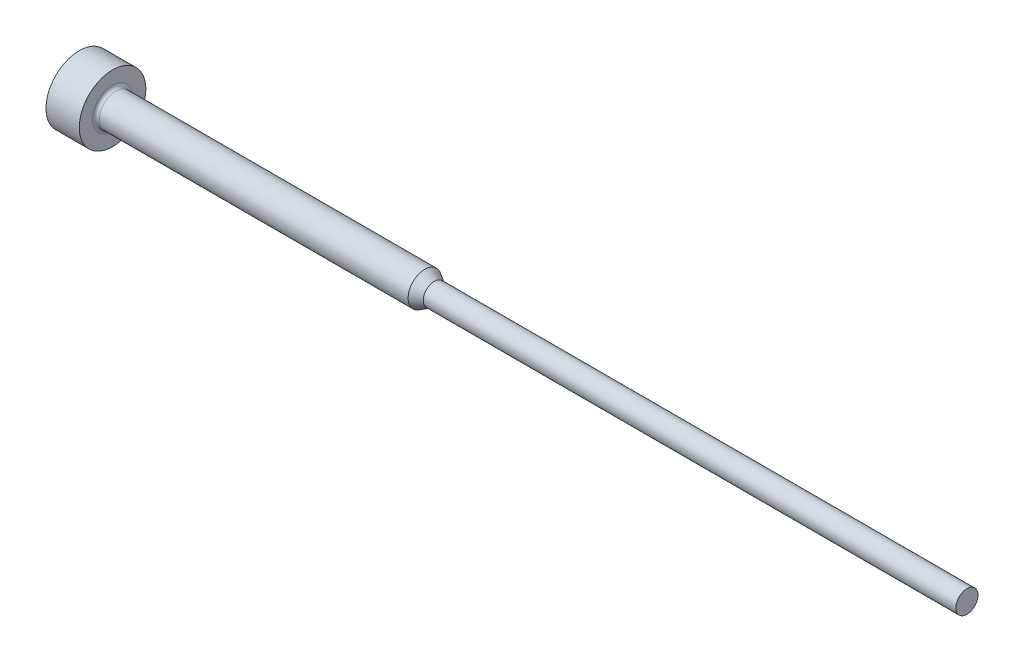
ISO-10303-21;
HEADER;
FILE_DESCRIPTION(('STEP AP214'),'2;1');
FILE_NAME('part.step','',(''),(''),'','','');
FILE_SCHEMA(('AUTOMOTIVE_DESIGN { 1 0 10303 214 1 1 1 1 }'));
ENDSEC;
DATA;
#1=APPLICATION_CONTEXT('core data for automotive mechanical design processes');
#2=APPLICATION_PROTOCOL_DEFINITION('international standard','automotive_design',2000,#1);
#3=PRODUCT_CONTEXT('',#1,'mechanical');
#4=PRODUCT('Part','Part','',(#3));
#5=PRODUCT_RELATED_PRODUCT_CATEGORY('part','',(#4));
#6=PRODUCT_DEFINITION_FORMATION('','',#4);
#7=PRODUCT_DEFINITION_CONTEXT('part definition',#1,'design');
#8=PRODUCT_DEFINITION('design','',#6,#7);
#9=PRODUCT_DEFINITION_SHAPE('','',#8);
#10=(LENGTH_UNIT() NAMED_UNIT(*) SI_UNIT(.MILLI.,.METRE.));
#11=(NAMED_UNIT(*) PLANE_ANGLE_UNIT() SI_UNIT($,.RADIAN.));
#12=(NAMED_UNIT(*) SI_UNIT($,.STERADIAN.) SOLID_ANGLE_UNIT());
#13=UNCERTAINTY_MEASURE_WITH_UNIT(LENGTH_MEASURE(1.E-05),#10,'distance_accuracy_value','');
#14=(GEOMETRIC_REPRESENTATION_CONTEXT(3) GLOBAL_UNCERTAINTY_ASSIGNED_CONTEXT((#13)) GLOBAL_UNIT_ASSIGNED_CONTEXT((#10,
#11,#12)) REPRESENTATION_CONTEXT('',''));
#15=CARTESIAN_POINT('',(0.,0.,0.));
#16=DIRECTION('',(0.,0.,1.));
#17=DIRECTION('',(1.,0.,0.));
#18=AXIS2_PLACEMENT_3D('',#15,#16,#17);
#19=CARTESIAN_POINT('',(0.,0.,0.));
#20=DIRECTION('',(1.,0.,0.));
#21=DIRECTION('',(0.,1.,0.));
#22=AXIS2_PLACEMENT_3D('',#19,#20,#21);
#23=PLANE('',#22);
#24=CARTESIAN_POINT('',(0.,0.,0.));
#25=DIRECTION('',(-1.,0.,0.));
#26=DIRECTION('',(0.,-1.,0.));
#27=AXIS2_PLACEMENT_3D('',#24,#25,#26);
#28=CIRCLE('',#27,3.);
#29=CARTESIAN_POINT('',(0.,-3.,0.));
#30=VERTEX_POINT('',#29);
#31=EDGE_CURVE('E29',#30,#30,#28,.T.);
#32=ORIENTED_EDGE('',*,*,#31,.T.);
#33=EDGE_LOOP('',(#32));
#34=FACE_BOUND('',#33,.T.);
#35=ADVANCED_FACE('F14',(#34),#23,.F.);
#36=CARTESIAN_POINT('',(0.,0.,0.));
#37=DIRECTION('',(-1.,0.,0.));
#38=DIRECTION('',(0.,-1.,0.));
#39=AXIS2_PLACEMENT_3D('',#36,#37,#38);
#40=CYLINDRICAL_SURFACE('',#39,3.);
#41=ORIENTED_EDGE('',*,*,#31,.F.);
#42=EDGE_LOOP('',(#41));
#43=FACE_BOUND('',#42,.T.);
#44=CARTESIAN_POINT('',(3.,0.,0.));
#45=DIRECTION('',(-1.,0.,0.));
#46=DIRECTION('',(0.,-1.,0.));
#47=AXIS2_PLACEMENT_3D('',#44,#45,#46);
#48=CIRCLE('',#47,3.);
#49=CARTESIAN_POINT('',(3.,-3.,0.));
#50=VERTEX_POINT('',#49);
#51=EDGE_CURVE('E35',#50,#50,#48,.T.);
#52=ORIENTED_EDGE('',*,*,#51,.T.);
#53=EDGE_LOOP('',(#52));
#54=FACE_BOUND('',#53,.T.);
#55=ADVANCED_FACE('F66',(#43,#54),#40,.T.);
#56=CARTESIAN_POINT('',(3.,3.,0.));
#57=DIRECTION('',(-1.,0.,0.));
#58=DIRECTION('',(0.,-1.,0.));
#59=AXIS2_PLACEMENT_3D('',#56,#57,#58);
#60=PLANE('',#59);
#61=CARTESIAN_POINT('',(3.,0.,0.));
#62=DIRECTION('',(-1.,0.,0.));
#63=DIRECTION('',(0.,-1.,0.));
#64=AXIS2_PLACEMENT_3D('',#61,#62,#63);
#65=CIRCLE('',#64,1.8);
#66=CARTESIAN_POINT('',(3.,-1.8,0.));
#67=VERTEX_POINT('',#66);
#68=EDGE_CURVE('E22',#67,#67,#65,.T.);
#69=ORIENTED_EDGE('',*,*,#68,.T.);
#70=EDGE_LOOP('',(#69));
#71=FACE_BOUND('',#70,.T.);
#72=ORIENTED_EDGE('',*,*,#51,.F.);
#73=EDGE_LOOP('',(#72));
#74=FACE_BOUND('',#73,.T.);
#75=ADVANCED_FACE('F70',(#71,#74),#60,.F.);
#76=CARTESIAN_POINT('',(0.,0.,0.));
#77=DIRECTION('',(-1.,0.,0.));
#78=DIRECTION('',(0.,-1.,0.));
#79=AXIS2_PLACEMENT_3D('',#76,#77,#78);
#80=CYLINDRICAL_SURFACE('',#79,1.49999999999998);
#81=CARTESIAN_POINT('',(3.3,0.,0.));
#82=DIRECTION('',(-1.,0.,0.));
#83=DIRECTION('',(0.,-1.,0.));
#84=AXIS2_PLACEMENT_3D('',#81,#82,#83);
#85=CIRCLE('',#84,1.49999999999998);
#86=CARTESIAN_POINT('',(3.3,-1.49999999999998,0.));
#87=VERTEX_POINT('',#86);
#88=EDGE_CURVE('E9',#87,#87,#85,.F.);
#89=ORIENTED_EDGE('',*,*,#88,.T.);
#90=EDGE_LOOP('',(#89));
#91=FACE_BOUND('',#90,.T.);
#92=CARTESIAN_POINT('',(31.1339745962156,0.,0.));
#93=DIRECTION('',(-1.,0.,0.));
#94=DIRECTION('',(0.,-1.,0.));
#95=AXIS2_PLACEMENT_3D('',#92,#93,#94);
#96=CIRCLE('',#95,1.49999999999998);
#97=CARTESIAN_POINT('',(31.1339745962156,-1.49999999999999,0.));
#98=VERTEX_POINT('',#97);
#99=EDGE_CURVE('E40',#98,#98,#96,.T.);
#100=ORIENTED_EDGE('',*,*,#99,.T.);
#101=EDGE_LOOP('',(#100));
#102=FACE_BOUND('',#101,.T.);
#103=ADVANCED_FACE('F76',(#91,#102),#80,.T.);
#104=CARTESIAN_POINT('',(32.,0.,0.));
#105=DIRECTION('',(-1.,0.,0.));
#106=DIRECTION('',(0.,-1.,0.));
#107=AXIS2_PLACEMENT_3D('',#104,#105,#106);
#108=CONICAL_SURFACE('',#107,1.,0.523598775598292);
#109=ORIENTED_EDGE('',*,*,#99,.F.);
#110=EDGE_LOOP('',(#109));
#111=FACE_BOUND('',#110,.T.);
#112=CARTESIAN_POINT('',(32.,0.,0.));
#113=DIRECTION('',(-1.,0.,0.));
#114=DIRECTION('',(0.,-1.,0.));
#115=AXIS2_PLACEMENT_3D('',#112,#113,#114);
#116=CIRCLE('',#115,1.);
#117=CARTESIAN_POINT('',(32.,-1.00000000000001,0.));
#118=VERTEX_POINT('',#117);
#119=EDGE_CURVE('E44',#118,#118,#116,.T.);
#120=ORIENTED_EDGE('',*,*,#119,.T.);
#121=EDGE_LOOP('',(#120));
#122=FACE_BOUND('',#121,.T.);
#123=ADVANCED_FACE('F62',(#111,#122),#108,.T.);
#124=CARTESIAN_POINT('',(0.,0.,0.));
#125=DIRECTION('',(-1.,0.,0.));
#126=DIRECTION('',(0.,-1.,0.));
#127=AXIS2_PLACEMENT_3D('',#124,#125,#126);
#128=CYLINDRICAL_SURFACE('',#127,1.);
#129=ORIENTED_EDGE('',*,*,#119,.F.);
#130=EDGE_LOOP('',(#129));
#131=FACE_BOUND('',#130,.T.);
#132=CARTESIAN_POINT('',(80.,0.,0.));
#133=DIRECTION('',(-1.,0.,0.));
#134=DIRECTION('',(0.,-1.,0.));
#135=AXIS2_PLACEMENT_3D('',#132,#133,#134);
#136=CIRCLE('',#135,1.);
#137=CARTESIAN_POINT('',(80.,-1.00000000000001,0.));
#138=VERTEX_POINT('',#137);
#139=EDGE_CURVE('E47',#138,#138,#136,.T.);
#140=ORIENTED_EDGE('',*,*,#139,.T.);
#141=EDGE_LOOP('',(#140));
#142=FACE_BOUND('',#141,.T.);
#143=ADVANCED_FACE('F52',(#131,#142),#128,.T.);
#144=CARTESIAN_POINT('',(80.,0.999999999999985,0.));
#145=DIRECTION('',(-1.,0.,0.));
#146=DIRECTION('',(0.,-1.,0.));
#147=AXIS2_PLACEMENT_3D('',#144,#145,#146);
#148=PLANE('',#147);
#149=ORIENTED_EDGE('',*,*,#139,.F.);
#150=EDGE_LOOP('',(#149));
#151=FACE_BOUND('',#150,.T.);
#152=ADVANCED_FACE('F54',(#151),#148,.F.);
#153=CARTESIAN_POINT('',(3.3,0.,0.));
#154=DIRECTION('',(-1.,0.,0.));
#155=DIRECTION('',(0.,-1.,0.));
#156=AXIS2_PLACEMENT_3D('',#153,#154,#155);
#157=TOROIDAL_SURFACE('',#156,1.8,0.3);
#158=ORIENTED_EDGE('',*,*,#88,.F.);
#159=EDGE_LOOP('',(#158));
#160=FACE_BOUND('',#159,.T.);
#161=ORIENTED_EDGE('',*,*,#68,.F.);
#162=EDGE_LOOP('',(#161));
#163=FACE_BOUND('',#162,.T.);
#164=ADVANCED_FACE('F16',(#160,#163),#157,.F.);
#165=CLOSED_SHELL('',(#35,#55,#75,#103,#123,#143,#152,#164));
#166=MANIFOLD_SOLID_BREP('B1',#165);
#167=ADVANCED_BREP_SHAPE_REPRESENTATION('',(#18,#166),#14);
#168=SHAPE_DEFINITION_REPRESENTATION(#9,#167);
ENDSEC;
END-ISO-10303-21;
